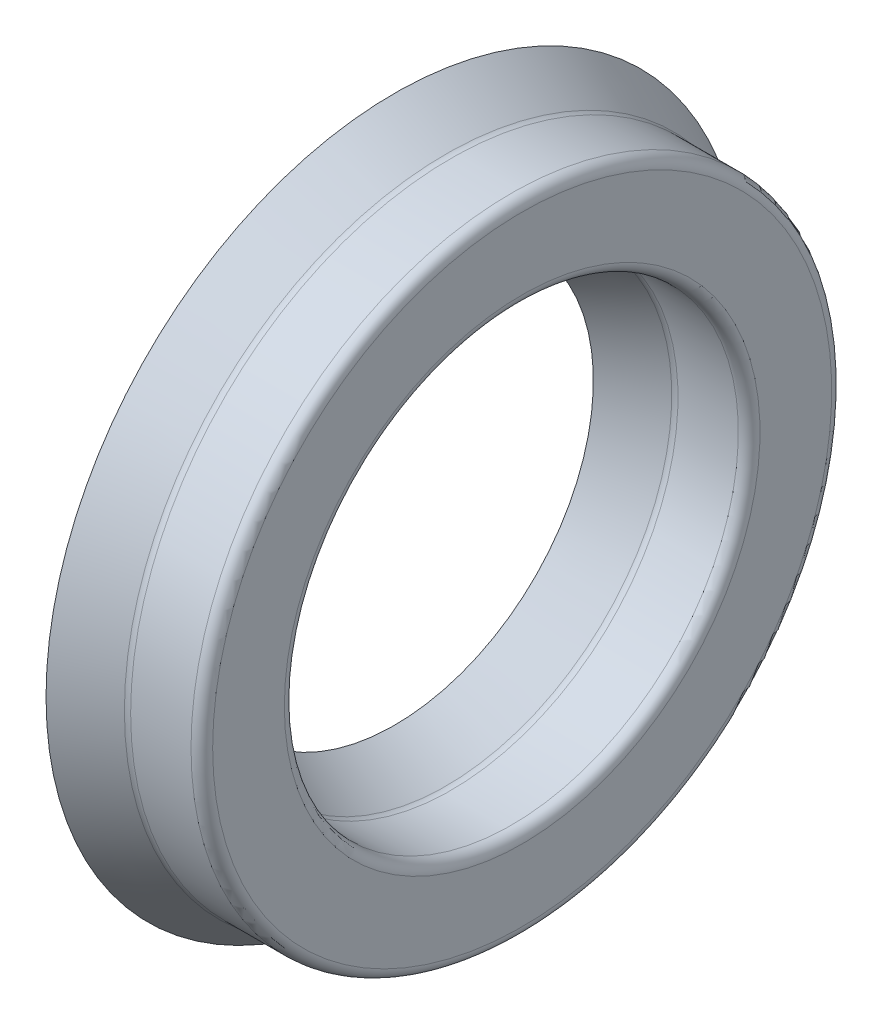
from build123d import *


with BuildPart() as part:
    # Sketch3 → Revolve1 (revolve)
    with BuildSketch(Plane.XY, mode=Mode.PRIVATE) as revolve1_sk:
        with BuildLine():
            Line((-0.857129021, 5.5626), (-0.035422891, 5.133371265))
            ThreePointArc((-0.035422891, 5.133371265), (0.003398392, 5.118713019), (0.044594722, 5.1137312))
            Line((0.044594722, 5.1137312), (1.008275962, 5.1137312))
            ThreePointArc((1.008275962, 5.1137312), (1.130481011, 5.063112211), (1.1811, 4.940907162))
            Line((1.1811, 4.940907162), (1.1811, 3.796692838))
            ThreePointArc((1.1811, 3.796692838), (1.130481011, 3.674487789), (1.008275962, 3.6238688))
            Line((1.008275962, 3.6238688), (0.044594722, 3.6238688))
            ThreePointArc((0.044594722, 3.6238688), (0.003398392, 3.618886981), (-0.035422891, 3.604228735))
            Line((-0.035422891, 3.604228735), (-0.857129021, 3.175))
            Line((-0.857129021, 3.175), (-1.1811, 3.795202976))
            Line((-1.1811, 3.795202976), (-0.376270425, 4.215616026))
            ThreePointArc((-0.376270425, 4.215616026), (-0.283464, 4.3688), (-0.376270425, 4.521983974))
            Line((-0.376270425, 4.521983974), (-1.1811, 4.942397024))
            Line((-1.1811, 4.942397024), (-0.857129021, 5.5626))
        make_face()
    revolve(revolve1_sk.sketch.rotate(Axis((-1.1811, 0, 0), (1, 0, 0)), 90), axis=Axis((-1.1811, 0, 0), (1, 0, 0)))


solid = part.part
